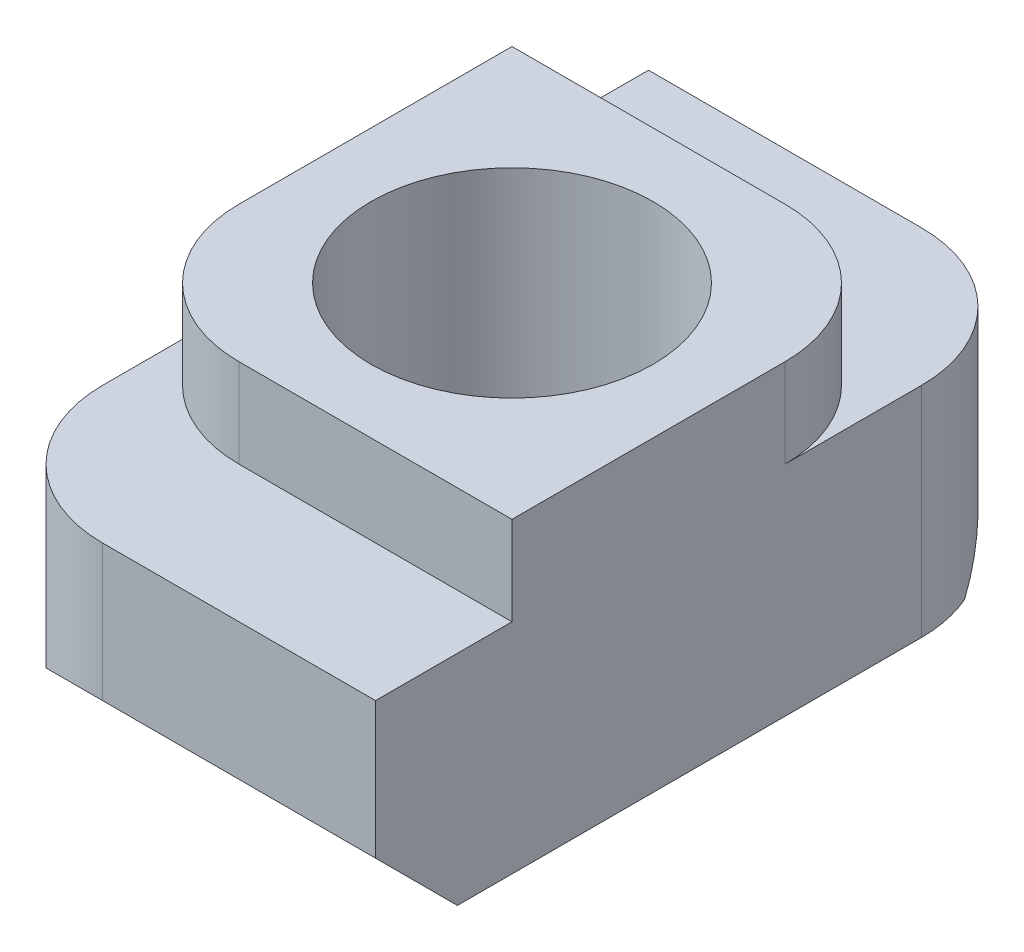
from build123d import *

# Parameters (mm, degrees)
BOSS_EXTRUDE1_DEPTH = 3
FILLET1_R           = 2
TAP1_D              = 4.134


with BuildPart() as part:
    # Sketch1 → Boss-Extrude1 (new, symmetric)
    with BuildSketch(Plane(origin=(0, 0, 0), x_dir=(0, 0, -1), z_dir=(1, 0, 0))):
        Polygon((-3, 0), (3, 0), (3, -1.3), (5, -1.3), (5, -3.3), (3.8, -4.5), (-3.8, -4.5), (-5, -3.3), (-5, -1.3), (-3, -1.3), align=None)
    extrude(amount=BOSS_EXTRUDE1_DEPTH, both=True)

    # Fillet1
    fillet1_edges = [part.edges().sort_by_distance(p)[0] for p in [
        (3, -2.3, -5),
        (-3, -2.3, 5),
        (3, -0.65, -3),
        (-3, -0.65, 3),
    ]]
    fillet(fillet1_edges, radius=FILLET1_R)

    # Tap1 (through all)
    with Locations(Plane(origin=(0, 0, 0), x_dir=(1, 0, 0), z_dir=(0, 1, 0))):
        with Locations((0, 0)):
            Hole(TAP1_D / 2)


solid = part.part
